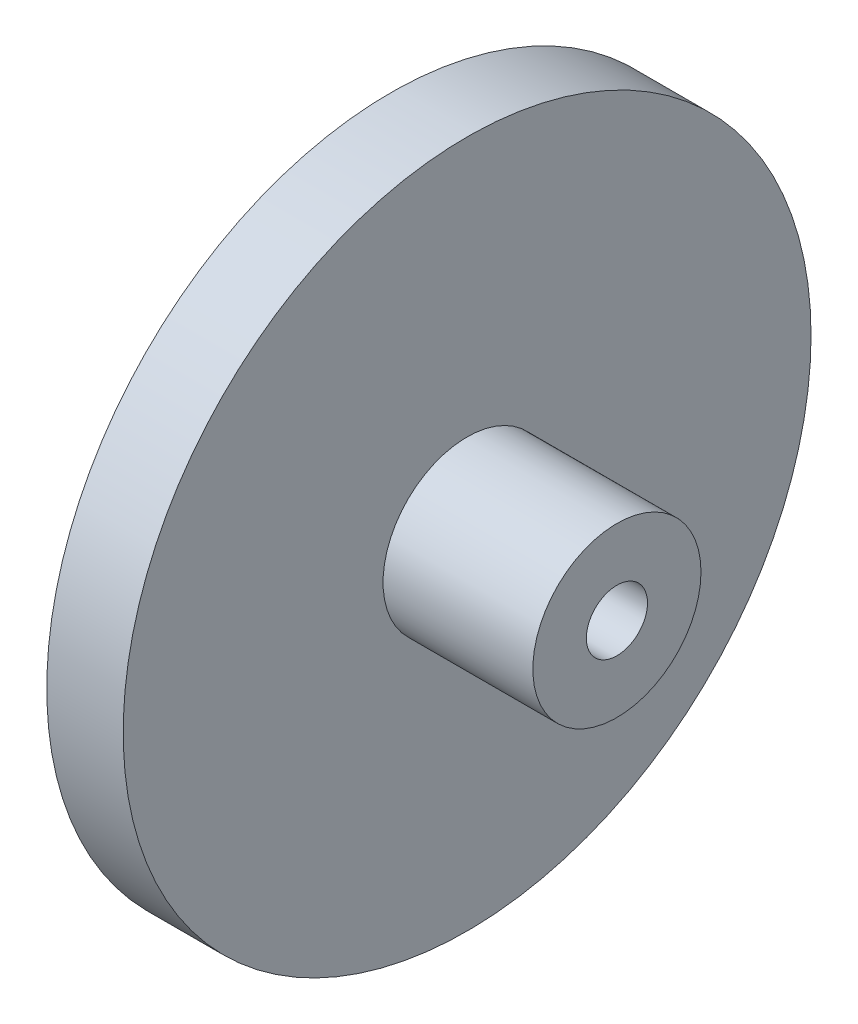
from build123d import *


with BuildPart() as part:
    # Esquisse1 → Base-R_volution (revolve)
    with BuildSketch(Plane.XY, mode=Mode.PRIVATE) as base_r_volution_sk:
        Polygon((-7.4, 11.25), (-4.9, 11.25), (-4.9, 2.75), (0, 2.75), (0, 1), (-7.4, 1), (-7.4, 2.9), (-6.15, 2.9), (-6.15, 7.75), (-7.4, 8.75), align=None)
    revolve(base_r_volution_sk.sketch.rotate(Axis((9.858979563, 0, 0), (-1, 0, 0)), 90), axis=Axis((9.858979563, 0, 0), (-1, 0, 0)))


solid = part.part
